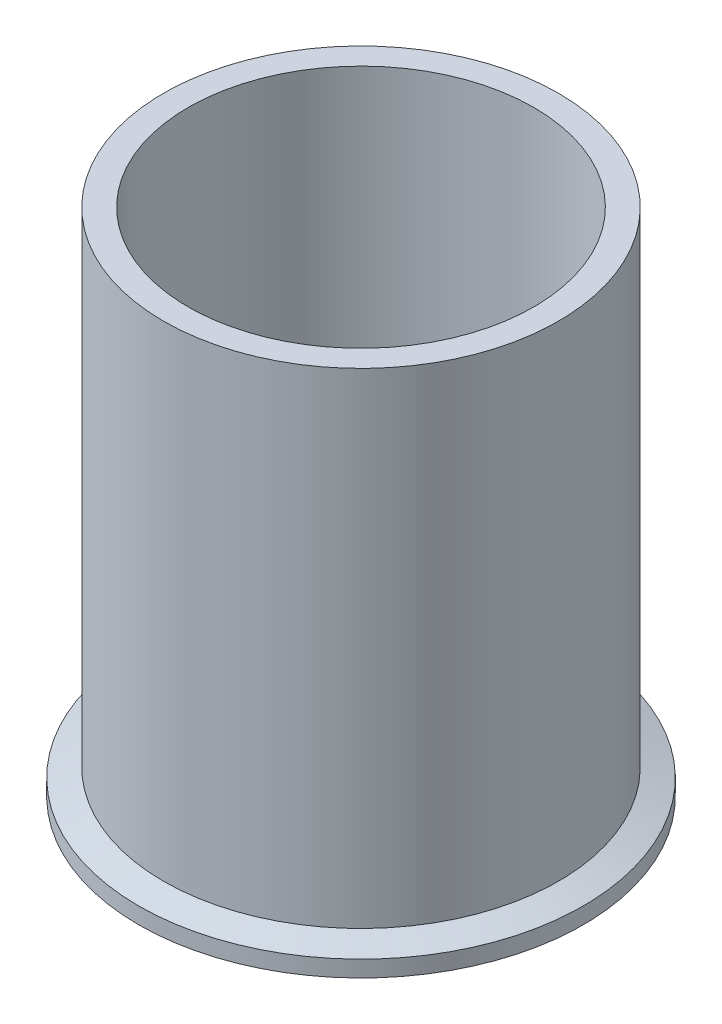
from build123d import *


with BuildPart() as part:
    # Sketch1 → Revolve2 (revolve)
    with BuildSketch(Plane.XY, mode=Mode.PRIVATE) as revolve2_sk:
        with BuildLine():
            Line((-30.099, 0), (-30.099, 88.9))
            Line((-30.099, 88.9), (-34.3916, 88.9))
            Line((-34.3916, 88.9), (-34.3916, 4.416423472))
            Line((-34.3916, 4.416423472), (-38.7096, 2.8448))
            Line((-38.7096, 2.8448), (-38.7096, 0))
            Line((-38.7096, 0), (-36.788103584, 0))
            Line((-36.788103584, 0), (-36.417598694, 0.872854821))
            ThreePointArc((-36.417598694, 0.872854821), (-35.259772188, 1.598744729), (-34.179162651, 0.762227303))
            Line((-34.179162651, 0.762227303), (-33.855616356, 0))
            Line((-33.855616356, 0), (-30.099, 0))
        make_face()
    revolve(revolve2_sk.sketch.rotate(Axis((0, 0, 0), (0, 1, 0)), 270), axis=Axis((0, 0, 0), (0, 1, 0)))


solid = part.part
